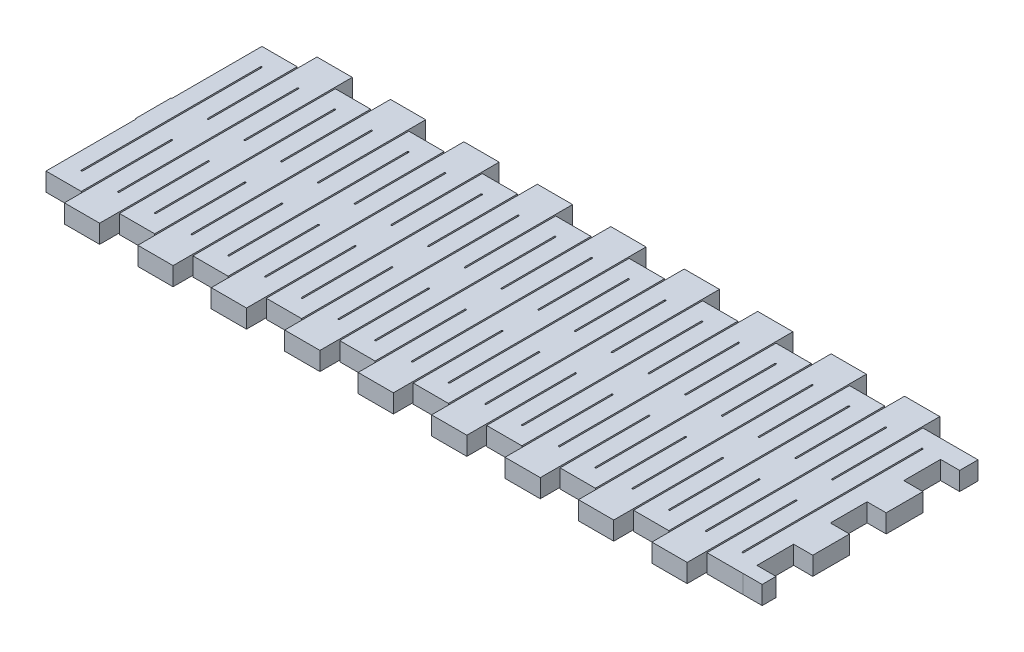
from build123d import *

# Parameters (mm, degrees)
SKETCH1_W           = 123.952
SKETCH1_H           = 43.688
BODY_DEPTH          = 3.175
SLOTS_DEPTH         = 3.175
SKETCH4_W           = 6.35
SKETCH4_H           = 3.175
TEETH_DEPTH         = 3.175
TEETH_PATTERN_COUNT = 10
TEETH_PATTERN_PITCH = 12.7
SLOTS_PATTERN_COUNT = 19
SLOTS_PATTERN_PITCH = 6.35
SKETCH6_W           = 3.556
SKETCH6_H           = 3.175
SKETCH6_H_2         = 6.35
SKETCH6_H_3         = 3.185663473
CUT_EXTRUDE5_DEPTH  = 3.175


with BuildPart() as part:
    # Sketch1 → body (new body)
    with BuildSketch(Plane(origin=(0, 0, 0), x_dir=(1, 0, 0), z_dir=(0, 1, 0))):
        with Locations((61.976, 21.844)):
            Rectangle(SKETCH1_W, SKETCH1_H)
    extrude(amount=BODY_DEPTH)

    # Sketch2 → slots (cut)
    with BuildSketch(Plane(origin=(0, 3.175, 0), x_dir=(1, 0, 0), z_dir=(0, 1, 0))):
        with BuildLine():
            Line((0.127, 43.688), (0.127, 25.019))
            ThreePointArc((0.127, 25.019), (0, 24.892), (-0.127, 25.019))
            Line((-0.127, 25.019), (-0.127, 43.688))
            ThreePointArc((-0.127, 43.688), (0, 43.815), (0.127, 43.688))
        make_face()
        with BuildLine():
            Line((0.127, 0), (0.127, 18.669))
            ThreePointArc((0.127, 18.669), (0, 18.796), (-0.127, 18.669))
            Line((-0.127, 18.669), (-0.127, 0))
            ThreePointArc((-0.127, 0), (0, -0.127), (0.127, 0))
        make_face()
        with BuildLine():
            Line((3.302, 37.338), (3.302, 6.35))
            ThreePointArc((3.302, 6.35), (3.175, 6.223), (3.048, 6.35))
            Line((3.048, 6.35), (3.048, 37.338))
            ThreePointArc((3.048, 37.338), (3.175, 37.465), (3.302, 37.338))
        make_face()
    slots = extrude(amount=-SLOTS_DEPTH, mode=Mode.SUBTRACT)

    # Sketch4 → teeth (cut)
    with BuildSketch(Plane(origin=(0, 3.175, 0), x_dir=(1, 0, 0), z_dir=(0, 1, 0))):
        with Locations((3.175, 42.1005)):
            Rectangle(SKETCH4_W, SKETCH4_H)
        with Locations((3.175, 1.5875)):
            Rectangle(SKETCH4_W, SKETCH4_H)
    teeth = extrude(amount=-TEETH_DEPTH, mode=Mode.SUBTRACT)

    # teeth pattern: teeth ×10
    with Locations(*[(i * TEETH_PATTERN_PITCH, 0, 0) for i in range(1, TEETH_PATTERN_COUNT)]):
        add(teeth, mode=Mode.SUBTRACT)

    # slots pattern: slots ×19
    with Locations(*[(i * SLOTS_PATTERN_PITCH, 0, 0) for i in range(1, SLOTS_PATTERN_COUNT)]):
        add(slots, mode=Mode.SUBTRACT)

    # Sketch6 → Cut-Extrude5 (cut)
    with BuildSketch(Plane(origin=(0, 3.175, 0), x_dir=(1, 0, 0), z_dir=(0, 1, 0))):
        with Locations((122.428, 42.1005)):
            Rectangle(SKETCH6_W, SKETCH6_H)
        with Locations((122.428, 34.163)):
            Rectangle(SKETCH6_W, SKETCH6_H_2)
        with Locations((122.428, 21.463)):
            Rectangle(SKETCH6_W, SKETCH6_H_2)
        with Locations((122.428, 8.763)):
            Rectangle(SKETCH6_W, SKETCH6_H_2)
        with Locations((122.428, 1.592831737)):
            Rectangle(SKETCH6_W, SKETCH6_H_3)
    extrude(amount=-CUT_EXTRUDE5_DEPTH, mode=Mode.SUBTRACT)


solid = part.part
